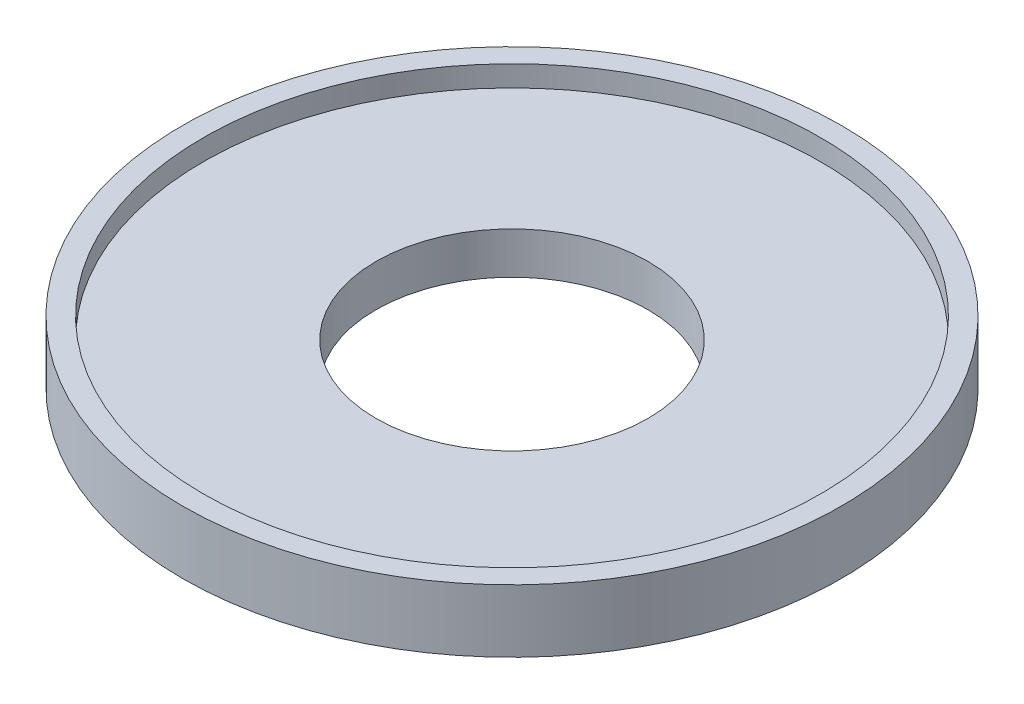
ISO-10303-21;
HEADER;
FILE_DESCRIPTION(('STEP AP214'),'2;1');
FILE_NAME('part.step','',(''),(''),'','','');
FILE_SCHEMA(('AUTOMOTIVE_DESIGN { 1 0 10303 214 1 1 1 1 }'));
ENDSEC;
DATA;
#1=APPLICATION_CONTEXT('core data for automotive mechanical design processes');
#2=APPLICATION_PROTOCOL_DEFINITION('international standard','automotive_design',2000,#1);
#3=PRODUCT_CONTEXT('',#1,'mechanical');
#4=PRODUCT('Part','Part','',(#3));
#5=PRODUCT_RELATED_PRODUCT_CATEGORY('part','',(#4));
#6=PRODUCT_DEFINITION_FORMATION('','',#4);
#7=PRODUCT_DEFINITION_CONTEXT('part definition',#1,'design');
#8=PRODUCT_DEFINITION('design','',#6,#7);
#9=PRODUCT_DEFINITION_SHAPE('','',#8);
#10=(LENGTH_UNIT() NAMED_UNIT(*) SI_UNIT(.MILLI.,.METRE.));
#11=(NAMED_UNIT(*) PLANE_ANGLE_UNIT() SI_UNIT($,.RADIAN.));
#12=(NAMED_UNIT(*) SI_UNIT($,.STERADIAN.) SOLID_ANGLE_UNIT());
#13=UNCERTAINTY_MEASURE_WITH_UNIT(LENGTH_MEASURE(1.E-05),#10,'distance_accuracy_value','');
#14=(GEOMETRIC_REPRESENTATION_CONTEXT(3) GLOBAL_UNCERTAINTY_ASSIGNED_CONTEXT((#13)) GLOBAL_UNIT_ASSIGNED_CONTEXT((#10,
#11,#12)) REPRESENTATION_CONTEXT('',''));
#15=CARTESIAN_POINT('',(0.,0.,0.));
#16=DIRECTION('',(0.,0.,1.));
#17=DIRECTION('',(1.,0.,0.));
#18=AXIS2_PLACEMENT_3D('',#15,#16,#17);
#19=CARTESIAN_POINT('',(0.,0.,0.));
#20=DIRECTION('',(0.,1.,0.));
#21=DIRECTION('',(0.,0.,1.));
#22=AXIS2_PLACEMENT_3D('',#19,#20,#21);
#23=CYLINDRICAL_SURFACE('',#22,13.);
#24=CARTESIAN_POINT('',(0.,0.,0.));
#25=DIRECTION('',(0.,1.,0.));
#26=DIRECTION('',(0.,0.,1.));
#27=AXIS2_PLACEMENT_3D('',#24,#25,#26);
#28=CIRCLE('',#27,13.);
#29=CARTESIAN_POINT('',(0.,0.,13.));
#30=VERTEX_POINT('',#29);
#31=EDGE_CURVE('E56',#30,#30,#28,.T.);
#32=ORIENTED_EDGE('',*,*,#31,.F.);
#33=EDGE_LOOP('',(#32));
#34=FACE_BOUND('',#33,.T.);
#35=CARTESIAN_POINT('',(0.,4.,0.));
#36=DIRECTION('',(0.,1.,0.));
#37=DIRECTION('',(0.,0.,1.));
#38=AXIS2_PLACEMENT_3D('',#35,#36,#37);
#39=CIRCLE('',#38,13.);
#40=CARTESIAN_POINT('',(0.,4.,13.));
#41=VERTEX_POINT('',#40);
#42=EDGE_CURVE('E47',#41,#41,#39,.F.);
#43=ORIENTED_EDGE('',*,*,#42,.F.);
#44=EDGE_LOOP('',(#43));
#45=FACE_BOUND('',#44,.T.);
#46=ADVANCED_FACE('F43',(#34,#45),#23,.F.);
#47=CARTESIAN_POINT('',(0.,6.,0.));
#48=DIRECTION('',(0.,-1.,0.));
#49=DIRECTION('',(0.,0.,-1.));
#50=AXIS2_PLACEMENT_3D('',#47,#48,#49);
#51=CYLINDRICAL_SURFACE('',#50,31.5);
#52=CARTESIAN_POINT('',(0.,6.,0.));
#53=DIRECTION('',(0.,1.,0.));
#54=DIRECTION('',(0.,0.,1.));
#55=AXIS2_PLACEMENT_3D('',#52,#53,#54);
#56=CIRCLE('',#55,31.5);
#57=CARTESIAN_POINT('',(0.,6.,31.5));
#58=VERTEX_POINT('',#57);
#59=EDGE_CURVE('E10',#58,#58,#56,.T.);
#60=ORIENTED_EDGE('',*,*,#59,.F.);
#61=EDGE_LOOP('',(#60));
#62=FACE_BOUND('',#61,.T.);
#63=CARTESIAN_POINT('',(0.,0.,0.));
#64=DIRECTION('',(0.,1.,0.));
#65=DIRECTION('',(0.,0.,1.));
#66=AXIS2_PLACEMENT_3D('',#63,#64,#65);
#67=CIRCLE('',#66,31.5);
#68=CARTESIAN_POINT('',(0.,0.,31.5));
#69=VERTEX_POINT('',#68);
#70=EDGE_CURVE('E51',#69,#69,#67,.T.);
#71=ORIENTED_EDGE('',*,*,#70,.T.);
#72=EDGE_LOOP('',(#71));
#73=FACE_BOUND('',#72,.T.);
#74=ADVANCED_FACE('F45',(#62,#73),#51,.T.);
#75=CARTESIAN_POINT('',(0.,6.,0.));
#76=DIRECTION('',(0.,1.,0.));
#77=DIRECTION('',(0.,0.,1.));
#78=AXIS2_PLACEMENT_3D('',#75,#76,#77);
#79=PLANE('',#78);
#80=CARTESIAN_POINT('',(0.,6.,0.));
#81=DIRECTION('',(0.,1.,0.));
#82=DIRECTION('',(0.,0.,1.));
#83=AXIS2_PLACEMENT_3D('',#80,#81,#82);
#84=CIRCLE('',#83,29.5);
#85=CARTESIAN_POINT('',(0.,6.,29.5));
#86=VERTEX_POINT('',#85);
#87=EDGE_CURVE('E60',#86,#86,#84,.T.);
#88=ORIENTED_EDGE('',*,*,#87,.F.);
#89=EDGE_LOOP('',(#88));
#90=FACE_BOUND('',#89,.T.);
#91=ORIENTED_EDGE('',*,*,#59,.T.);
#92=EDGE_LOOP('',(#91));
#93=FACE_BOUND('',#92,.T.);
#94=ADVANCED_FACE('F80',(#90,#93),#79,.T.);
#95=CARTESIAN_POINT('',(0.,0.,0.));
#96=DIRECTION('',(0.,1.,0.));
#97=DIRECTION('',(0.,0.,1.));
#98=AXIS2_PLACEMENT_3D('',#95,#96,#97);
#99=PLANE('',#98);
#100=ORIENTED_EDGE('',*,*,#31,.T.);
#101=EDGE_LOOP('',(#100));
#102=FACE_BOUND('',#101,.T.);
#103=ORIENTED_EDGE('',*,*,#70,.F.);
#104=EDGE_LOOP('',(#103));
#105=FACE_BOUND('',#104,.T.);
#106=ADVANCED_FACE('F87',(#102,#105),#99,.F.);
#107=CARTESIAN_POINT('',(0.,4.,0.));
#108=DIRECTION('',(0.,1.,0.));
#109=DIRECTION('',(0.,0.,1.));
#110=AXIS2_PLACEMENT_3D('',#107,#108,#109);
#111=PLANE('',#110);
#112=CARTESIAN_POINT('',(0.,4.,0.));
#113=DIRECTION('',(0.,1.,0.));
#114=DIRECTION('',(0.,0.,1.));
#115=AXIS2_PLACEMENT_3D('',#112,#113,#114);
#116=CIRCLE('',#115,29.5);
#117=CARTESIAN_POINT('',(0.,4.,29.5));
#118=VERTEX_POINT('',#117);
#119=EDGE_CURVE('E63',#118,#118,#116,.T.);
#120=ORIENTED_EDGE('',*,*,#119,.T.);
#121=EDGE_LOOP('',(#120));
#122=FACE_BOUND('',#121,.T.);
#123=ORIENTED_EDGE('',*,*,#42,.T.);
#124=EDGE_LOOP('',(#123));
#125=FACE_BOUND('',#124,.T.);
#126=ADVANCED_FACE('F70',(#122,#125),#111,.T.);
#127=CARTESIAN_POINT('',(0.,4.,0.));
#128=DIRECTION('',(0.,1.,0.));
#129=DIRECTION('',(0.,0.,1.));
#130=AXIS2_PLACEMENT_3D('',#127,#128,#129);
#131=CYLINDRICAL_SURFACE('',#130,29.5);
#132=ORIENTED_EDGE('',*,*,#119,.F.);
#133=EDGE_LOOP('',(#132));
#134=FACE_BOUND('',#133,.T.);
#135=ORIENTED_EDGE('',*,*,#87,.T.);
#136=EDGE_LOOP('',(#135));
#137=FACE_BOUND('',#136,.T.);
#138=ADVANCED_FACE('F85',(#134,#137),#131,.F.);
#139=CLOSED_SHELL('',(#46,#74,#94,#106,#126,#138));
#140=MANIFOLD_SOLID_BREP('B2',#139);
#141=ADVANCED_BREP_SHAPE_REPRESENTATION('',(#18,#140),#14);
#142=SHAPE_DEFINITION_REPRESENTATION(#9,#141);
ENDSEC;
END-ISO-10303-21;
